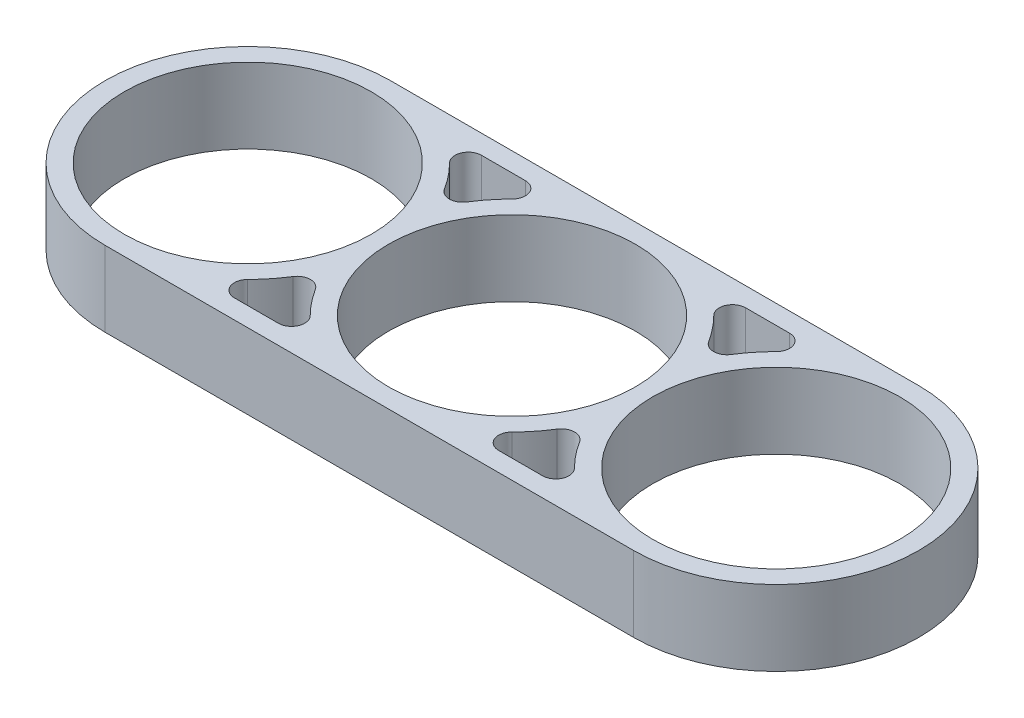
from build123d import *

# Parameters (mm, degrees)
SKIZZE1_R                       = 9.35
AUFSATZ_LINEAR_AUSTRAGEN1_DEPTH = 5.7


with BuildPart() as part:
    # Skizze1 → Aufsatz-Linear austragen1 (new body)
    with BuildSketch(Plane(origin=(0, 0, 0), x_dir=(1, 0, 0), z_dir=(0, 1, 0))):
        with BuildLine():
            Line((-20, 10.8), (20, 10.8))
            ThreePointArc((20, 10.8), (30.8, 0), (20, -10.8))
            Line((20, -10.8), (-20, -10.8))
            ThreePointArc((-20, -10.8), (-30.8, 0), (-20, 10.8))
        make_face()
        with Locations(Location((-20, 0, 0), (0, 0, 270))):
            Circle(SKIZZE1_R, mode=Mode.SUBTRACT)
        with Locations(Location((0, 0, 0), (0, 0, 270))):
            Circle(SKIZZE1_R, mode=Mode.SUBTRACT)
        with Locations(Location((20, 0, 0), (0, 0, 270))):
            Circle(SKIZZE1_R, mode=Mode.SUBTRACT)
        with BuildLine():
            Line((-11.662284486, 9.35), (-8.337715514, 9.35))
            ThreePointArc((-8.337715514, 9.35), (-7.41369519, 8.732343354), (-7.631129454, 7.642372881))
            ThreePointArc((-7.631129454, 7.642372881), (-8.445947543, 6.730970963), (-9.152542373, 5.733320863))
            ThreePointArc((-9.152542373, 5.733320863), (-10, 5.264183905), (-10.847457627, 5.733320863))
            ThreePointArc((-10.847457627, 5.733320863), (-11.554052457, 6.730970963), (-12.368870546, 7.642372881))
            ThreePointArc((-12.368870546, 7.642372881), (-12.58630481, 8.732343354), (-11.662284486, 9.35))
        make_face(mode=Mode.SUBTRACT)
        with BuildLine():
            Line((-11.662284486, -9.35), (-8.337715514, -9.35))
            ThreePointArc((-8.337715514, -9.35), (-7.41369519, -8.732343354), (-7.631129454, -7.642372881))
            ThreePointArc((-7.631129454, -7.642372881), (-8.445947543, -6.730970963), (-9.152542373, -5.733320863))
            ThreePointArc((-9.152542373, -5.733320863), (-10, -5.264183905), (-10.847457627, -5.733320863))
            ThreePointArc((-10.847457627, -5.733320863), (-11.554052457, -6.730970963), (-12.368870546, -7.642372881))
            ThreePointArc((-12.368870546, -7.642372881), (-12.58630481, -8.732343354), (-11.662284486, -9.35))
        make_face(mode=Mode.SUBTRACT)
        with BuildLine():
            Line((8.337715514, -9.35), (11.662284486, -9.35))
            ThreePointArc((11.662284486, -9.35), (12.58630481, -8.732343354), (12.368870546, -7.642372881))
            ThreePointArc((12.368870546, -7.642372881), (11.554052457, -6.730970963), (10.847457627, -5.733320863))
            ThreePointArc((10.847457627, -5.733320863), (10, -5.264183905), (9.152542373, -5.733320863))
            ThreePointArc((9.152542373, -5.733320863), (8.445947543, -6.730970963), (7.631129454, -7.642372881))
            ThreePointArc((7.631129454, -7.642372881), (7.41369519, -8.732343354), (8.337715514, -9.35))
        make_face(mode=Mode.SUBTRACT)
        with BuildLine():
            Line((8.337715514, 9.35), (11.662284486, 9.35))
            ThreePointArc((11.662284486, 9.35), (12.58630481, 8.732343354), (12.368870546, 7.642372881))
            ThreePointArc((12.368870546, 7.642372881), (11.554052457, 6.730970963), (10.847457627, 5.733320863))
            ThreePointArc((10.847457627, 5.733320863), (10, 5.264183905), (9.152542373, 5.733320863))
            ThreePointArc((9.152542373, 5.733320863), (8.445947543, 6.730970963), (7.631129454, 7.642372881))
            ThreePointArc((7.631129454, 7.642372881), (7.41369519, 8.732343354), (8.337715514, 9.35))
        make_face(mode=Mode.SUBTRACT)
    extrude(amount=AUFSATZ_LINEAR_AUSTRAGEN1_DEPTH)


solid = part.part
